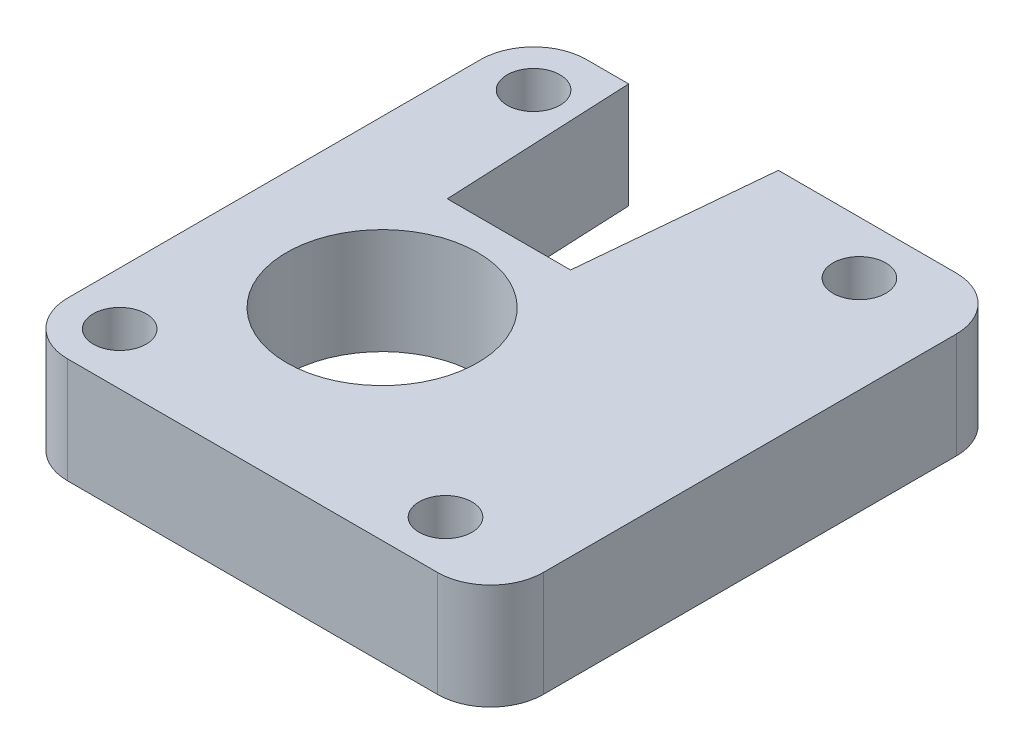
ISO-10303-21;
HEADER;
FILE_DESCRIPTION(('STEP AP214'),'2;1');
FILE_NAME('part.step','',(''),(''),'','','');
FILE_SCHEMA(('AUTOMOTIVE_DESIGN { 1 0 10303 214 1 1 1 1 }'));
ENDSEC;
DATA;
#1=APPLICATION_CONTEXT('core data for automotive mechanical design processes');
#2=APPLICATION_PROTOCOL_DEFINITION('international standard','automotive_design',2000,#1);
#3=PRODUCT_CONTEXT('',#1,'mechanical');
#4=PRODUCT('Part','Part','',(#3));
#5=PRODUCT_RELATED_PRODUCT_CATEGORY('part','',(#4));
#6=PRODUCT_DEFINITION_FORMATION('','',#4);
#7=PRODUCT_DEFINITION_CONTEXT('part definition',#1,'design');
#8=PRODUCT_DEFINITION('design','',#6,#7);
#9=PRODUCT_DEFINITION_SHAPE('','',#8);
#10=(LENGTH_UNIT() NAMED_UNIT(*) SI_UNIT(.MILLI.,.METRE.));
#11=(NAMED_UNIT(*) PLANE_ANGLE_UNIT() SI_UNIT($,.RADIAN.));
#12=(NAMED_UNIT(*) SI_UNIT($,.STERADIAN.) SOLID_ANGLE_UNIT());
#13=UNCERTAINTY_MEASURE_WITH_UNIT(LENGTH_MEASURE(1.E-05),#10,'distance_accuracy_value','');
#14=(GEOMETRIC_REPRESENTATION_CONTEXT(3) GLOBAL_UNCERTAINTY_ASSIGNED_CONTEXT((#13)) GLOBAL_UNIT_ASSIGNED_CONTEXT((#10,
#11,#12)) REPRESENTATION_CONTEXT('',''));
#15=CARTESIAN_POINT('',(0.,0.,0.));
#16=DIRECTION('',(0.,0.,1.));
#17=DIRECTION('',(1.,0.,0.));
#18=AXIS2_PLACEMENT_3D('',#15,#16,#17);
#19=CARTESIAN_POINT('',(0.,3.,0.));
#20=DIRECTION('',(0.,1.,0.));
#21=DIRECTION('',(0.,0.,1.));
#22=AXIS2_PLACEMENT_3D('',#19,#20,#21);
#23=PLANE('',#22);
#24=CARTESIAN_POINT('',(-4.1,3.,3.275));
#25=DIRECTION('',(0.,1.,0.));
#26=DIRECTION('',(0.,0.,1.));
#27=AXIS2_PLACEMENT_3D('',#24,#25,#26);
#28=CIRCLE('',#27,5.425);
#29=CARTESIAN_POINT('',(-4.1,3.,8.7));
#30=VERTEX_POINT('',#29);
#31=EDGE_CURVE('E187',#30,#30,#28,.F.);
#32=ORIENTED_EDGE('',*,*,#31,.T.);
#33=EDGE_LOOP('',(#32));
#34=FACE_BOUND('',#33,.T.);
#35=CARTESIAN_POINT('',(-10.5,3.,-11.725));
#36=DIRECTION('',(0.,1.,0.));
#37=DIRECTION('',(0.,0.,1.));
#38=AXIS2_PLACEMENT_3D('',#35,#36,#37);
#39=CIRCLE('',#38,1.5);
#40=CARTESIAN_POINT('',(-10.5,3.,-10.225));
#41=VERTEX_POINT('',#40);
#42=EDGE_CURVE('E190',#41,#41,#39,.F.);
#43=ORIENTED_EDGE('',*,*,#42,.T.);
#44=EDGE_LOOP('',(#43));
#45=FACE_BOUND('',#44,.T.);
#46=CARTESIAN_POINT('',(-10.5,3.,11.775));
#47=DIRECTION('',(0.,1.,0.));
#48=DIRECTION('',(0.,0.,1.));
#49=AXIS2_PLACEMENT_3D('',#46,#47,#48);
#50=CIRCLE('',#49,1.5);
#51=CARTESIAN_POINT('',(-10.5,3.,13.275));
#52=VERTEX_POINT('',#51);
#53=EDGE_CURVE('E193',#52,#52,#50,.F.);
#54=ORIENTED_EDGE('',*,*,#53,.T.);
#55=EDGE_LOOP('',(#54));
#56=FACE_BOUND('',#55,.T.);
#57=CARTESIAN_POINT('',(8.,3.,11.775));
#58=DIRECTION('',(0.,1.,0.));
#59=DIRECTION('',(0.,0.,1.));
#60=AXIS2_PLACEMENT_3D('',#57,#58,#59);
#61=CIRCLE('',#60,1.5);
#62=CARTESIAN_POINT('',(8.,3.,13.275));
#63=VERTEX_POINT('',#62);
#64=EDGE_CURVE('E196',#63,#63,#61,.F.);
#65=ORIENTED_EDGE('',*,*,#64,.T.);
#66=EDGE_LOOP('',(#65));
#67=FACE_BOUND('',#66,.T.);
#68=CARTESIAN_POINT('',(8.,3.,-11.725));
#69=DIRECTION('',(0.,1.,0.));
#70=DIRECTION('',(0.,0.,1.));
#71=AXIS2_PLACEMENT_3D('',#68,#69,#70);
#72=CIRCLE('',#71,1.5);
#73=CARTESIAN_POINT('',(8.,3.,-10.225));
#74=VERTEX_POINT('',#73);
#75=EDGE_CURVE('E199',#74,#74,#72,.F.);
#76=ORIENTED_EDGE('',*,*,#75,.T.);
#77=EDGE_LOOP('',(#76));
#78=FACE_BOUND('',#77,.T.);
#79=DIRECTION('',(-1.,0.,0.));
#80=VECTOR('',#79,1.);
#81=CARTESIAN_POINT('',(-8.1,3.,-14.725));
#82=LINE('',#81,#80);
#83=CARTESIAN_POINT('',(-10.5,3.,-14.725));
#84=VERTEX_POINT('',#83);
#85=CARTESIAN_POINT('',(-8.1,3.,-14.725));
#86=VERTEX_POINT('',#85);
#87=EDGE_CURVE('E117',#84,#86,#82,.F.);
#88=ORIENTED_EDGE('',*,*,#87,.F.);
#89=CARTESIAN_POINT('',(-10.5,3.,-11.725));
#90=DIRECTION('',(0.,1.,0.));
#91=DIRECTION('',(0.,0.,1.));
#92=AXIS2_PLACEMENT_3D('',#89,#90,#91);
#93=CIRCLE('',#92,3.);
#94=CARTESIAN_POINT('',(-13.5,3.,-11.725));
#95=VERTEX_POINT('',#94);
#96=EDGE_CURVE('E20',#95,#84,#93,.F.);
#97=ORIENTED_EDGE('',*,*,#96,.F.);
#98=DIRECTION('',(0.,0.,1.));
#99=VECTOR('',#98,1.);
#100=CARTESIAN_POINT('',(-13.5,3.,-11.725));
#101=LINE('',#100,#99);
#102=CARTESIAN_POINT('',(-13.5,3.,11.725));
#103=VERTEX_POINT('',#102);
#104=EDGE_CURVE('E103',#103,#95,#101,.F.);
#105=ORIENTED_EDGE('',*,*,#104,.F.);
#106=CARTESIAN_POINT('',(-10.5,3.,11.725));
#107=DIRECTION('',(0.,1.,0.));
#108=DIRECTION('',(0.,0.,1.));
#109=AXIS2_PLACEMENT_3D('',#106,#107,#108);
#110=CIRCLE('',#109,3.);
#111=CARTESIAN_POINT('',(-10.5,3.,14.725));
#112=VERTEX_POINT('',#111);
#113=EDGE_CURVE('E124',#112,#103,#110,.F.);
#114=ORIENTED_EDGE('',*,*,#113,.F.);
#115=DIRECTION('',(1.,0.,0.));
#116=VECTOR('',#115,1.);
#117=CARTESIAN_POINT('',(-10.5,3.,14.725));
#118=LINE('',#117,#116);
#119=CARTESIAN_POINT('',(10.5,3.,14.725));
#120=VERTEX_POINT('',#119);
#121=EDGE_CURVE('E158',#120,#112,#118,.F.);
#122=ORIENTED_EDGE('',*,*,#121,.F.);
#123=CARTESIAN_POINT('',(10.5,3.,11.725));
#124=DIRECTION('',(0.,1.,0.));
#125=DIRECTION('',(0.,0.,1.));
#126=AXIS2_PLACEMENT_3D('',#123,#124,#125);
#127=CIRCLE('',#126,3.);
#128=CARTESIAN_POINT('',(13.5,3.,11.725));
#129=VERTEX_POINT('',#128);
#130=EDGE_CURVE('E204',#129,#120,#127,.F.);
#131=ORIENTED_EDGE('',*,*,#130,.F.);
#132=DIRECTION('',(0.,0.,-1.));
#133=VECTOR('',#132,1.);
#134=CARTESIAN_POINT('',(13.5,3.,11.725));
#135=LINE('',#134,#133);
#136=CARTESIAN_POINT('',(13.5,3.,-11.725));
#137=VERTEX_POINT('',#136);
#138=EDGE_CURVE('E154',#137,#129,#135,.F.);
#139=ORIENTED_EDGE('',*,*,#138,.F.);
#140=CARTESIAN_POINT('',(10.5,3.,-11.725));
#141=DIRECTION('',(0.,1.,0.));
#142=DIRECTION('',(0.,0.,1.));
#143=AXIS2_PLACEMENT_3D('',#140,#141,#142);
#144=CIRCLE('',#143,3.);
#145=CARTESIAN_POINT('',(10.5,3.,-14.725));
#146=VERTEX_POINT('',#145);
#147=EDGE_CURVE('E202',#146,#137,#144,.F.);
#148=ORIENTED_EDGE('',*,*,#147,.F.);
#149=DIRECTION('',(-1.,0.,0.));
#150=VECTOR('',#149,1.);
#151=CARTESIAN_POINT('',(10.5,3.,-14.725));
#152=LINE('',#151,#150);
#153=CARTESIAN_POINT('',(0.4,3.,-14.725));
#154=VERTEX_POINT('',#153);
#155=EDGE_CURVE('E149',#154,#146,#152,.F.);
#156=ORIENTED_EDGE('',*,*,#155,.F.);
#157=DIRECTION('',(-0.0921982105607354,0.,0.99574067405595));
#158=VECTOR('',#157,1.);
#159=CARTESIAN_POINT('',(0.4,3.,-14.725));
#160=LINE('',#159,#158);
#161=CARTESIAN_POINT('',(-0.599999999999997,3.,-3.925));
#162=VERTEX_POINT('',#161);
#163=EDGE_CURVE('E144',#162,#154,#160,.F.);
#164=ORIENTED_EDGE('',*,*,#163,.F.);
#165=DIRECTION('',(-1.,0.,0.));
#166=VECTOR('',#165,1.);
#167=CARTESIAN_POINT('',(-0.6,3.,-3.925));
#168=LINE('',#167,#166);
#169=CARTESIAN_POINT('',(-7.6,3.,-3.925));
#170=VERTEX_POINT('',#169);
#171=EDGE_CURVE('E139',#170,#162,#168,.F.);
#172=ORIENTED_EDGE('',*,*,#171,.F.);
#173=DIRECTION('',(-0.04624676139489,0.,-0.9989300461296));
#174=VECTOR('',#173,1.);
#175=CARTESIAN_POINT('',(-7.6,3.,-3.925));
#176=LINE('',#175,#174);
#177=EDGE_CURVE('E129',#86,#170,#176,.F.);
#178=ORIENTED_EDGE('',*,*,#177,.F.);
#179=EDGE_LOOP('',(#88,#97,#105,#114,#122,#131,#139,#148,#156,#164,#172,#178));
#180=FACE_BOUND('',#179,.T.);
#181=ADVANCED_FACE('F17',(#34,#45,#56,#67,#78,#180),#23,.T.);
#182=CARTESIAN_POINT('',(-10.5,-3.,-11.725));
#183=DIRECTION('',(0.,1.,0.));
#184=DIRECTION('',(0.,0.,1.));
#185=AXIS2_PLACEMENT_3D('',#182,#183,#184);
#186=CYLINDRICAL_SURFACE('',#185,3.);
#187=DIRECTION('',(0.,1.,0.));
#188=VECTOR('',#187,1.);
#189=CARTESIAN_POINT('',(-10.5,-3.,-14.725));
#190=LINE('',#189,#188);
#191=CARTESIAN_POINT('',(-10.5,-3.,-14.725));
#192=VERTEX_POINT('',#191);
#193=EDGE_CURVE('E136',#192,#84,#190,.T.);
#194=ORIENTED_EDGE('',*,*,#193,.F.);
#195=CARTESIAN_POINT('',(-10.5,-3.,-11.725));
#196=DIRECTION('',(0.,1.,0.));
#197=DIRECTION('',(0.,0.,1.));
#198=AXIS2_PLACEMENT_3D('',#195,#196,#197);
#199=CIRCLE('',#198,3.);
#200=CARTESIAN_POINT('',(-13.5,-3.,-11.725));
#201=VERTEX_POINT('',#200);
#202=EDGE_CURVE('E123',#192,#201,#199,.T.);
#203=ORIENTED_EDGE('',*,*,#202,.T.);
#204=DIRECTION('',(0.,1.,0.));
#205=VECTOR('',#204,1.);
#206=CARTESIAN_POINT('',(-13.5,-3.,-11.725));
#207=LINE('',#206,#205);
#208=EDGE_CURVE('E108',#95,#201,#207,.F.);
#209=ORIENTED_EDGE('',*,*,#208,.F.);
#210=ORIENTED_EDGE('',*,*,#96,.T.);
#211=EDGE_LOOP('',(#194,#203,#209,#210));
#212=FACE_BOUND('',#211,.T.);
#213=ADVANCED_FACE('F122',(#212),#186,.T.);
#214=CARTESIAN_POINT('',(-13.5,-3.,-11.725));
#215=DIRECTION('',(-1.,0.,0.));
#216=DIRECTION('',(0.,0.,1.));
#217=AXIS2_PLACEMENT_3D('',#214,#215,#216);
#218=PLANE('',#217);
#219=ORIENTED_EDGE('',*,*,#208,.T.);
#220=DIRECTION('',(0.,0.,1.));
#221=VECTOR('',#220,1.);
#222=CARTESIAN_POINT('',(-13.5,-3.,0.));
#223=LINE('',#222,#221);
#224=CARTESIAN_POINT('',(-13.5,-3.,11.725));
#225=VERTEX_POINT('',#224);
#226=EDGE_CURVE('E185',#201,#225,#223,.T.);
#227=ORIENTED_EDGE('',*,*,#226,.T.);
#228=DIRECTION('',(0.,1.,0.));
#229=VECTOR('',#228,1.);
#230=CARTESIAN_POINT('',(-13.5,-3.,11.725));
#231=LINE('',#230,#229);
#232=EDGE_CURVE('E110',#103,#225,#231,.F.);
#233=ORIENTED_EDGE('',*,*,#232,.F.);
#234=ORIENTED_EDGE('',*,*,#104,.T.);
#235=EDGE_LOOP('',(#219,#227,#233,#234));
#236=FACE_BOUND('',#235,.T.);
#237=ADVANCED_FACE('F105',(#236),#218,.T.);
#238=CARTESIAN_POINT('',(-10.5,-3.,11.725));
#239=DIRECTION('',(0.,1.,0.));
#240=DIRECTION('',(0.,0.,1.));
#241=AXIS2_PLACEMENT_3D('',#238,#239,#240);
#242=CYLINDRICAL_SURFACE('',#241,3.);
#243=ORIENTED_EDGE('',*,*,#232,.T.);
#244=CARTESIAN_POINT('',(-10.5,-3.,11.725));
#245=DIRECTION('',(0.,1.,0.));
#246=DIRECTION('',(0.,0.,1.));
#247=AXIS2_PLACEMENT_3D('',#244,#245,#246);
#248=CIRCLE('',#247,3.);
#249=CARTESIAN_POINT('',(-10.5,-3.,14.725));
#250=VERTEX_POINT('',#249);
#251=EDGE_CURVE('E182',#225,#250,#248,.T.);
#252=ORIENTED_EDGE('',*,*,#251,.T.);
#253=DIRECTION('',(0.,1.,0.));
#254=VECTOR('',#253,1.);
#255=CARTESIAN_POINT('',(-10.5,-3.,14.725));
#256=LINE('',#255,#254);
#257=EDGE_CURVE('E159',#112,#250,#256,.F.);
#258=ORIENTED_EDGE('',*,*,#257,.F.);
#259=ORIENTED_EDGE('',*,*,#113,.T.);
#260=EDGE_LOOP('',(#243,#252,#258,#259));
#261=FACE_BOUND('',#260,.T.);
#262=ADVANCED_FACE('F293',(#261),#242,.T.);
#263=CARTESIAN_POINT('',(-10.5,-3.,14.725));
#264=DIRECTION('',(0.,0.,1.));
#265=DIRECTION('',(1.,0.,0.));
#266=AXIS2_PLACEMENT_3D('',#263,#264,#265);
#267=PLANE('',#266);
#268=ORIENTED_EDGE('',*,*,#257,.T.);
#269=DIRECTION('',(1.,0.,0.));
#270=VECTOR('',#269,1.);
#271=CARTESIAN_POINT('',(0.,-3.,14.725));
#272=LINE('',#271,#270);
#273=CARTESIAN_POINT('',(10.5,-3.,14.725));
#274=VERTEX_POINT('',#273);
#275=EDGE_CURVE('E181',#250,#274,#272,.T.);
#276=ORIENTED_EDGE('',*,*,#275,.T.);
#277=DIRECTION('',(0.,1.,0.));
#278=VECTOR('',#277,1.);
#279=CARTESIAN_POINT('',(10.5,-3.,14.725));
#280=LINE('',#279,#278);
#281=EDGE_CURVE('E157',#120,#274,#280,.F.);
#282=ORIENTED_EDGE('',*,*,#281,.F.);
#283=ORIENTED_EDGE('',*,*,#121,.T.);
#284=EDGE_LOOP('',(#268,#276,#282,#283));
#285=FACE_BOUND('',#284,.T.);
#286=ADVANCED_FACE('F290',(#285),#267,.T.);
#287=CARTESIAN_POINT('',(10.5,-3.,11.725));
#288=DIRECTION('',(0.,1.,0.));
#289=DIRECTION('',(0.,0.,1.));
#290=AXIS2_PLACEMENT_3D('',#287,#288,#289);
#291=CYLINDRICAL_SURFACE('',#290,3.);
#292=ORIENTED_EDGE('',*,*,#281,.T.);
#293=CARTESIAN_POINT('',(10.5,-3.,11.725));
#294=DIRECTION('',(0.,1.,0.));
#295=DIRECTION('',(0.,0.,1.));
#296=AXIS2_PLACEMENT_3D('',#293,#294,#295);
#297=CIRCLE('',#296,3.);
#298=CARTESIAN_POINT('',(13.5,-3.,11.725));
#299=VERTEX_POINT('',#298);
#300=EDGE_CURVE('E178',#274,#299,#297,.T.);
#301=ORIENTED_EDGE('',*,*,#300,.T.);
#302=DIRECTION('',(0.,1.,0.));
#303=VECTOR('',#302,1.);
#304=CARTESIAN_POINT('',(13.5,-3.,11.725));
#305=LINE('',#304,#303);
#306=EDGE_CURVE('E156',#129,#299,#305,.F.);
#307=ORIENTED_EDGE('',*,*,#306,.F.);
#308=ORIENTED_EDGE('',*,*,#130,.T.);
#309=EDGE_LOOP('',(#292,#301,#307,#308));
#310=FACE_BOUND('',#309,.T.);
#311=ADVANCED_FACE('F288',(#310),#291,.T.);
#312=CARTESIAN_POINT('',(13.5,-3.,11.725));
#313=DIRECTION('',(1.,0.,0.));
#314=DIRECTION('',(0.,0.,-1.));
#315=AXIS2_PLACEMENT_3D('',#312,#313,#314);
#316=PLANE('',#315);
#317=ORIENTED_EDGE('',*,*,#306,.T.);
#318=DIRECTION('',(0.,0.,1.));
#319=VECTOR('',#318,1.);
#320=CARTESIAN_POINT('',(13.5,-3.,0.));
#321=LINE('',#320,#319);
#322=CARTESIAN_POINT('',(13.5,-3.,-11.725));
#323=VERTEX_POINT('',#322);
#324=EDGE_CURVE('E177',#299,#323,#321,.F.);
#325=ORIENTED_EDGE('',*,*,#324,.T.);
#326=DIRECTION('',(0.,1.,0.));
#327=VECTOR('',#326,1.);
#328=CARTESIAN_POINT('',(13.5,-3.,-11.725));
#329=LINE('',#328,#327);
#330=EDGE_CURVE('E151',#137,#323,#329,.F.);
#331=ORIENTED_EDGE('',*,*,#330,.F.);
#332=ORIENTED_EDGE('',*,*,#138,.T.);
#333=EDGE_LOOP('',(#317,#325,#331,#332));
#334=FACE_BOUND('',#333,.T.);
#335=ADVANCED_FACE('F286',(#334),#316,.T.);
#336=CARTESIAN_POINT('',(10.5,-3.,-11.725));
#337=DIRECTION('',(0.,1.,0.));
#338=DIRECTION('',(0.,0.,1.));
#339=AXIS2_PLACEMENT_3D('',#336,#337,#338);
#340=CYLINDRICAL_SURFACE('',#339,3.);
#341=ORIENTED_EDGE('',*,*,#330,.T.);
#342=CARTESIAN_POINT('',(10.5,-3.,-11.725));
#343=DIRECTION('',(0.,1.,0.));
#344=DIRECTION('',(0.,0.,1.));
#345=AXIS2_PLACEMENT_3D('',#342,#343,#344);
#346=CIRCLE('',#345,3.);
#347=CARTESIAN_POINT('',(10.5,-3.,-14.725));
#348=VERTEX_POINT('',#347);
#349=EDGE_CURVE('E173',#323,#348,#346,.T.);
#350=ORIENTED_EDGE('',*,*,#349,.T.);
#351=DIRECTION('',(0.,1.,0.));
#352=VECTOR('',#351,1.);
#353=CARTESIAN_POINT('',(10.5,-3.,-14.725));
#354=LINE('',#353,#352);
#355=EDGE_CURVE('E146',#146,#348,#354,.F.);
#356=ORIENTED_EDGE('',*,*,#355,.F.);
#357=ORIENTED_EDGE('',*,*,#147,.T.);
#358=EDGE_LOOP('',(#341,#350,#356,#357));
#359=FACE_BOUND('',#358,.T.);
#360=ADVANCED_FACE('F282',(#359),#340,.T.);
#361=CARTESIAN_POINT('',(10.5,-3.,-14.725));
#362=DIRECTION('',(0.,0.,-1.));
#363=DIRECTION('',(-1.,0.,0.));
#364=AXIS2_PLACEMENT_3D('',#361,#362,#363);
#365=PLANE('',#364);
#366=ORIENTED_EDGE('',*,*,#355,.T.);
#367=DIRECTION('',(1.,0.,0.));
#368=VECTOR('',#367,1.);
#369=CARTESIAN_POINT('',(0.,-3.,-14.725));
#370=LINE('',#369,#368);
#371=CARTESIAN_POINT('',(0.4,-3.,-14.725));
#372=VERTEX_POINT('',#371);
#373=EDGE_CURVE('E176',#348,#372,#370,.F.);
#374=ORIENTED_EDGE('',*,*,#373,.T.);
#375=DIRECTION('',(0.,1.,0.));
#376=VECTOR('',#375,1.);
#377=CARTESIAN_POINT('',(0.4,-3.,-14.725));
#378=LINE('',#377,#376);
#379=EDGE_CURVE('E141',#154,#372,#378,.F.);
#380=ORIENTED_EDGE('',*,*,#379,.F.);
#381=ORIENTED_EDGE('',*,*,#155,.T.);
#382=EDGE_LOOP('',(#366,#374,#380,#381));
#383=FACE_BOUND('',#382,.T.);
#384=ADVANCED_FACE('F276',(#383),#365,.T.);
#385=CARTESIAN_POINT('',(0.4,-3.,-14.725));
#386=DIRECTION('',(-0.99574067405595,0.,-0.0921982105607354));
#387=DIRECTION('',(-0.0921982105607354,0.,0.99574067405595));
#388=AXIS2_PLACEMENT_3D('',#385,#386,#387);
#389=PLANE('',#388);
#390=ORIENTED_EDGE('',*,*,#379,.T.);
#391=DIRECTION('',(-0.0921982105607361,0.,0.99574067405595));
#392=VECTOR('',#391,1.);
#393=CARTESIAN_POINT('',(0.4,-3.,-14.725));
#394=LINE('',#393,#392);
#395=CARTESIAN_POINT('',(-0.6,-3.,-3.925));
#396=VERTEX_POINT('',#395);
#397=EDGE_CURVE('E223',#372,#396,#394,.T.);
#398=ORIENTED_EDGE('',*,*,#397,.T.);
#399=DIRECTION('',(0.,1.,0.));
#400=VECTOR('',#399,1.);
#401=CARTESIAN_POINT('',(-0.6,-3.,-3.925));
#402=LINE('',#401,#400);
#403=EDGE_CURVE('E132',#162,#396,#402,.F.);
#404=ORIENTED_EDGE('',*,*,#403,.F.);
#405=ORIENTED_EDGE('',*,*,#163,.T.);
#406=EDGE_LOOP('',(#390,#398,#404,#405));
#407=FACE_BOUND('',#406,.T.);
#408=ADVANCED_FACE('F272',(#407),#389,.T.);
#409=CARTESIAN_POINT('',(-0.6,-3.,-3.925));
#410=DIRECTION('',(0.,0.,-1.));
#411=DIRECTION('',(-1.,0.,0.));
#412=AXIS2_PLACEMENT_3D('',#409,#410,#411);
#413=PLANE('',#412);
#414=ORIENTED_EDGE('',*,*,#403,.T.);
#415=DIRECTION('',(1.,0.,0.));
#416=VECTOR('',#415,1.);
#417=CARTESIAN_POINT('',(0.,-3.,-3.925));
#418=LINE('',#417,#416);
#419=CARTESIAN_POINT('',(-7.6,-3.,-3.925));
#420=VERTEX_POINT('',#419);
#421=EDGE_CURVE('E226',#396,#420,#418,.F.);
#422=ORIENTED_EDGE('',*,*,#421,.T.);
#423=DIRECTION('',(0.,1.,0.));
#424=VECTOR('',#423,1.);
#425=CARTESIAN_POINT('',(-7.6,-3.,-3.925));
#426=LINE('',#425,#424);
#427=EDGE_CURVE('E131',#170,#420,#426,.F.);
#428=ORIENTED_EDGE('',*,*,#427,.F.);
#429=ORIENTED_EDGE('',*,*,#171,.T.);
#430=EDGE_LOOP('',(#414,#422,#428,#429));
#431=FACE_BOUND('',#430,.T.);
#432=ADVANCED_FACE('F266',(#431),#413,.T.);
#433=CARTESIAN_POINT('',(-7.6,-3.,-3.925));
#434=DIRECTION('',(0.9989300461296,0.,-0.04624676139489));
#435=DIRECTION('',(-0.04624676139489,0.,-0.9989300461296));
#436=AXIS2_PLACEMENT_3D('',#433,#434,#435);
#437=PLANE('',#436);
#438=ORIENTED_EDGE('',*,*,#427,.T.);
#439=DIRECTION('',(-0.0462467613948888,0.,-0.9989300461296));
#440=VECTOR('',#439,1.);
#441=CARTESIAN_POINT('',(-7.6,-3.,-3.925));
#442=LINE('',#441,#440);
#443=CARTESIAN_POINT('',(-8.1,-3.,-14.725));
#444=VERTEX_POINT('',#443);
#445=EDGE_CURVE('E234',#420,#444,#442,.T.);
#446=ORIENTED_EDGE('',*,*,#445,.T.);
#447=DIRECTION('',(0.,1.,0.));
#448=VECTOR('',#447,1.);
#449=CARTESIAN_POINT('',(-8.1,-3.,-14.725));
#450=LINE('',#449,#448);
#451=EDGE_CURVE('E35',#86,#444,#450,.F.);
#452=ORIENTED_EDGE('',*,*,#451,.F.);
#453=ORIENTED_EDGE('',*,*,#177,.T.);
#454=EDGE_LOOP('',(#438,#446,#452,#453));
#455=FACE_BOUND('',#454,.T.);
#456=ADVANCED_FACE('F262',(#455),#437,.T.);
#457=CARTESIAN_POINT('',(-8.1,-3.,-14.725));
#458=DIRECTION('',(0.,0.,-1.));
#459=DIRECTION('',(-1.,0.,0.));
#460=AXIS2_PLACEMENT_3D('',#457,#458,#459);
#461=PLANE('',#460);
#462=ORIENTED_EDGE('',*,*,#451,.T.);
#463=DIRECTION('',(1.,0.,0.));
#464=VECTOR('',#463,1.);
#465=CARTESIAN_POINT('',(0.,-3.,-14.725));
#466=LINE('',#465,#464);
#467=EDGE_CURVE('E172',#444,#192,#466,.F.);
#468=ORIENTED_EDGE('',*,*,#467,.T.);
#469=ORIENTED_EDGE('',*,*,#193,.T.);
#470=ORIENTED_EDGE('',*,*,#87,.T.);
#471=EDGE_LOOP('',(#462,#468,#469,#470));
#472=FACE_BOUND('',#471,.T.);
#473=ADVANCED_FACE('F256',(#472),#461,.T.);
#474=CARTESIAN_POINT('',(8.,-3.,-11.725));
#475=DIRECTION('',(0.,1.,0.));
#476=DIRECTION('',(0.,0.,1.));
#477=AXIS2_PLACEMENT_3D('',#474,#475,#476);
#478=CYLINDRICAL_SURFACE('',#477,1.5);
#479=ORIENTED_EDGE('',*,*,#75,.F.);
#480=EDGE_LOOP('',(#479));
#481=FACE_BOUND('',#480,.T.);
#482=CARTESIAN_POINT('',(8.,-3.,-11.725));
#483=DIRECTION('',(0.,1.,0.));
#484=DIRECTION('',(0.,0.,1.));
#485=AXIS2_PLACEMENT_3D('',#482,#483,#484);
#486=CIRCLE('',#485,1.5);
#487=CARTESIAN_POINT('',(8.,-3.,-10.225));
#488=VERTEX_POINT('',#487);
#489=EDGE_CURVE('E169',#488,#488,#486,.F.);
#490=ORIENTED_EDGE('',*,*,#489,.T.);
#491=EDGE_LOOP('',(#490));
#492=FACE_BOUND('',#491,.T.);
#493=ADVANCED_FACE('F326',(#481,#492),#478,.F.);
#494=CARTESIAN_POINT('',(8.,-3.,11.775));
#495=DIRECTION('',(0.,1.,0.));
#496=DIRECTION('',(0.,0.,1.));
#497=AXIS2_PLACEMENT_3D('',#494,#495,#496);
#498=CYLINDRICAL_SURFACE('',#497,1.5);
#499=ORIENTED_EDGE('',*,*,#64,.F.);
#500=EDGE_LOOP('',(#499));
#501=FACE_BOUND('',#500,.T.);
#502=CARTESIAN_POINT('',(8.,-3.,11.775));
#503=DIRECTION('',(0.,1.,0.));
#504=DIRECTION('',(0.,0.,1.));
#505=AXIS2_PLACEMENT_3D('',#502,#503,#504);
#506=CIRCLE('',#505,1.5);
#507=CARTESIAN_POINT('',(8.,-3.,13.275));
#508=VERTEX_POINT('',#507);
#509=EDGE_CURVE('E166',#508,#508,#506,.F.);
#510=ORIENTED_EDGE('',*,*,#509,.T.);
#511=EDGE_LOOP('',(#510));
#512=FACE_BOUND('',#511,.T.);
#513=ADVANCED_FACE('F322',(#501,#512),#498,.F.);
#514=CARTESIAN_POINT('',(-10.5,-3.,11.775));
#515=DIRECTION('',(0.,1.,0.));
#516=DIRECTION('',(0.,0.,1.));
#517=AXIS2_PLACEMENT_3D('',#514,#515,#516);
#518=CYLINDRICAL_SURFACE('',#517,1.5);
#519=ORIENTED_EDGE('',*,*,#53,.F.);
#520=EDGE_LOOP('',(#519));
#521=FACE_BOUND('',#520,.T.);
#522=CARTESIAN_POINT('',(-10.5,-3.,11.775));
#523=DIRECTION('',(0.,1.,0.));
#524=DIRECTION('',(0.,0.,1.));
#525=AXIS2_PLACEMENT_3D('',#522,#523,#524);
#526=CIRCLE('',#525,1.5);
#527=CARTESIAN_POINT('',(-10.5,-3.,13.275));
#528=VERTEX_POINT('',#527);
#529=EDGE_CURVE('E163',#528,#528,#526,.F.);
#530=ORIENTED_EDGE('',*,*,#529,.T.);
#531=EDGE_LOOP('',(#530));
#532=FACE_BOUND('',#531,.T.);
#533=ADVANCED_FACE('F318',(#521,#532),#518,.F.);
#534=CARTESIAN_POINT('',(-10.5,-3.,-11.725));
#535=DIRECTION('',(0.,1.,0.));
#536=DIRECTION('',(0.,0.,1.));
#537=AXIS2_PLACEMENT_3D('',#534,#535,#536);
#538=CYLINDRICAL_SURFACE('',#537,1.5);
#539=ORIENTED_EDGE('',*,*,#42,.F.);
#540=EDGE_LOOP('',(#539));
#541=FACE_BOUND('',#540,.T.);
#542=CARTESIAN_POINT('',(-10.5,-3.,-11.725));
#543=DIRECTION('',(0.,1.,0.));
#544=DIRECTION('',(0.,0.,1.));
#545=AXIS2_PLACEMENT_3D('',#542,#543,#544);
#546=CIRCLE('',#545,1.5);
#547=CARTESIAN_POINT('',(-10.5,-3.,-10.225));
#548=VERTEX_POINT('',#547);
#549=EDGE_CURVE('E26',#548,#548,#546,.F.);
#550=ORIENTED_EDGE('',*,*,#549,.T.);
#551=EDGE_LOOP('',(#550));
#552=FACE_BOUND('',#551,.T.);
#553=ADVANCED_FACE('F310',(#541,#552),#538,.F.);
#554=CARTESIAN_POINT('',(-4.1,-3.,3.275));
#555=DIRECTION('',(0.,1.,0.));
#556=DIRECTION('',(0.,0.,1.));
#557=AXIS2_PLACEMENT_3D('',#554,#555,#556);
#558=CYLINDRICAL_SURFACE('',#557,5.425);
#559=ORIENTED_EDGE('',*,*,#31,.F.);
#560=EDGE_LOOP('',(#559));
#561=FACE_BOUND('',#560,.T.);
#562=CARTESIAN_POINT('',(-4.1,-3.,3.275));
#563=DIRECTION('',(0.,1.,0.));
#564=DIRECTION('',(0.,0.,1.));
#565=AXIS2_PLACEMENT_3D('',#562,#563,#564);
#566=CIRCLE('',#565,5.425);
#567=CARTESIAN_POINT('',(-4.1,-3.,8.7));
#568=VERTEX_POINT('',#567);
#569=EDGE_CURVE('E11',#568,#568,#566,.F.);
#570=ORIENTED_EDGE('',*,*,#569,.T.);
#571=EDGE_LOOP('',(#570));
#572=FACE_BOUND('',#571,.T.);
#573=ADVANCED_FACE('F304',(#561,#572),#558,.F.);
#574=CARTESIAN_POINT('',(0.,-3.,0.));
#575=DIRECTION('',(0.,1.,0.));
#576=DIRECTION('',(0.,0.,1.));
#577=AXIS2_PLACEMENT_3D('',#574,#575,#576);
#578=PLANE('',#577);
#579=ORIENTED_EDGE('',*,*,#569,.F.);
#580=EDGE_LOOP('',(#579));
#581=FACE_BOUND('',#580,.T.);
#582=ORIENTED_EDGE('',*,*,#549,.F.);
#583=EDGE_LOOP('',(#582));
#584=FACE_BOUND('',#583,.T.);
#585=ORIENTED_EDGE('',*,*,#529,.F.);
#586=EDGE_LOOP('',(#585));
#587=FACE_BOUND('',#586,.T.);
#588=ORIENTED_EDGE('',*,*,#509,.F.);
#589=EDGE_LOOP('',(#588));
#590=FACE_BOUND('',#589,.T.);
#591=ORIENTED_EDGE('',*,*,#489,.F.);
#592=EDGE_LOOP('',(#591));
#593=FACE_BOUND('',#592,.T.);
#594=ORIENTED_EDGE('',*,*,#445,.F.);
#595=ORIENTED_EDGE('',*,*,#421,.F.);
#596=ORIENTED_EDGE('',*,*,#397,.F.);
#597=ORIENTED_EDGE('',*,*,#373,.F.);
#598=ORIENTED_EDGE('',*,*,#349,.F.);
#599=ORIENTED_EDGE('',*,*,#324,.F.);
#600=ORIENTED_EDGE('',*,*,#300,.F.);
#601=ORIENTED_EDGE('',*,*,#275,.F.);
#602=ORIENTED_EDGE('',*,*,#251,.F.);
#603=ORIENTED_EDGE('',*,*,#226,.F.);
#604=ORIENTED_EDGE('',*,*,#202,.F.);
#605=ORIENTED_EDGE('',*,*,#467,.F.);
#606=EDGE_LOOP('',(#594,#595,#596,#597,#598,#599,#600,#601,#602,#603,#604,#605));
#607=FACE_BOUND('',#606,.T.);
#608=ADVANCED_FACE('F259',(#581,#584,#587,#590,#593,#607),#578,.F.);
#609=CLOSED_SHELL('',(#181,#213,#237,#262,#286,#311,#335,#360,#384,#408,#432,#456,#473,#493,
#513,#533,#553,#573,#608));
#610=MANIFOLD_SOLID_BREP('B1',#609);
#611=ADVANCED_BREP_SHAPE_REPRESENTATION('',(#18,#610),#14);
#612=SHAPE_DEFINITION_REPRESENTATION(#9,#611);
ENDSEC;
END-ISO-10303-21;
